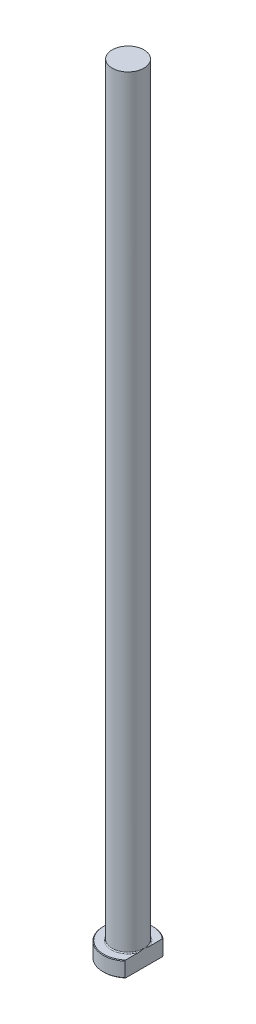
from build123d import *
from build123d.topology import SkipClean

# Parameters (mm, degrees)
CHAMFER1_SIZE = 0.2
FILLET1_R     = 0.3
KEY_DEPTH     = 251.255869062


with BuildPart() as part:
    # Sketch1 → Revolve1 (revolve)
    with BuildSketch(Plane.XY, mode=Mode.PRIVATE) as revolve1_sk:
        Polygon((0, 0), (-8, 0), (-8, 5), (-5.1, 5), (-5.1, 250), (0, 250), align=None)
    revolve(revolve1_sk.sketch.rotate(Axis((0, 259.958771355, 0), (0, -1, 0)), 270), axis=Axis((0, 259.958771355, 0), (0, -1, 0)))

    # Chamfer1
    chamfer1_edges = [part.edges().sort_by_distance(p)[0] for p in [
        (0, 5, -8),
        (0, 0, -8),
    ]]
    chamfer(chamfer1_edges, length=CHAMFER1_SIZE)

    # Fillet1
    fillet1_edges = [part.edges().sort_by_distance(p)[0] for p in [
        (0, 5, -5.1),
    ]]
    fillet(fillet1_edges, radius=FILLET1_R)

    # Sketch2 → KEY (cut, through all)
    with SkipClean():  # the faces are left unmerged after this step: merging them gives an invalid solid
        with BuildSketch(Plane(origin=(0, 0, 0), x_dir=(1, 0, 0), z_dir=(0, 1, 0))):
            with BuildLine():
                Line((5.1, 6.163602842), (5.1, -6.163602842))
                ThreePointArc((5.1, -6.163602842), (8, 0), (5.1, 6.163602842))
            make_face()
        extrude(amount=KEY_DEPTH, mode=Mode.SUBTRACT)


solid = part.part
